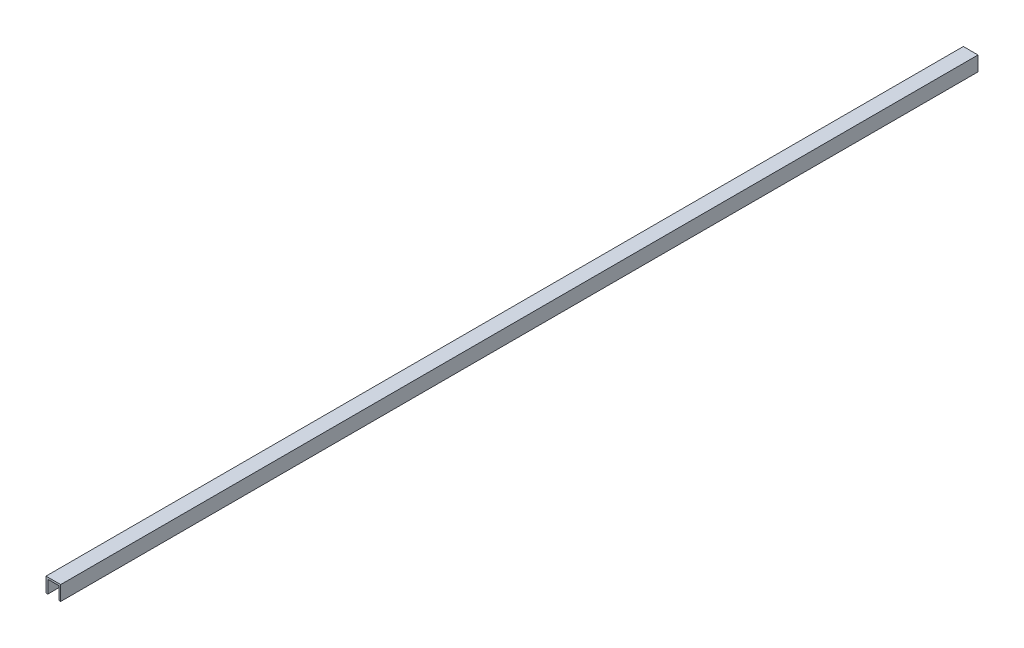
ISO-10303-21;
HEADER;
FILE_DESCRIPTION(('STEP AP214'),'2;1');
FILE_NAME('part.step','',(''),(''),'','','');
FILE_SCHEMA(('AUTOMOTIVE_DESIGN { 1 0 10303 214 1 1 1 1 }'));
ENDSEC;
DATA;
#1=APPLICATION_CONTEXT('core data for automotive mechanical design processes');
#2=APPLICATION_PROTOCOL_DEFINITION('international standard','automotive_design',2000,#1);
#3=PRODUCT_CONTEXT('',#1,'mechanical');
#4=PRODUCT('Part','Part','',(#3));
#5=PRODUCT_RELATED_PRODUCT_CATEGORY('part','',(#4));
#6=PRODUCT_DEFINITION_FORMATION('','',#4);
#7=PRODUCT_DEFINITION_CONTEXT('part definition',#1,'design');
#8=PRODUCT_DEFINITION('design','',#6,#7);
#9=PRODUCT_DEFINITION_SHAPE('','',#8);
#10=(LENGTH_UNIT() NAMED_UNIT(*) SI_UNIT(.MILLI.,.METRE.));
#11=(NAMED_UNIT(*) PLANE_ANGLE_UNIT() SI_UNIT($,.RADIAN.));
#12=(NAMED_UNIT(*) SI_UNIT($,.STERADIAN.) SOLID_ANGLE_UNIT());
#13=UNCERTAINTY_MEASURE_WITH_UNIT(LENGTH_MEASURE(1.E-05),#10,'distance_accuracy_value','');
#14=(GEOMETRIC_REPRESENTATION_CONTEXT(3) GLOBAL_UNCERTAINTY_ASSIGNED_CONTEXT((#13)) GLOBAL_UNIT_ASSIGNED_CONTEXT((#10,
#11,#12)) REPRESENTATION_CONTEXT('',''));
#15=CARTESIAN_POINT('',(0.,0.,0.));
#16=DIRECTION('',(0.,0.,1.));
#17=DIRECTION('',(1.,0.,0.));
#18=AXIS2_PLACEMENT_3D('',#15,#16,#17);
#19=CARTESIAN_POINT('',(4.,-4.,250.));
#20=DIRECTION('',(0.,-1.,0.));
#21=DIRECTION('',(1.,0.,0.));
#22=AXIS2_PLACEMENT_3D('',#19,#20,#21);
#23=PLANE('',#22);
#24=DIRECTION('',(-1.,0.,0.));
#25=VECTOR('',#24,1.);
#26=CARTESIAN_POINT('',(4.,-4.,250.));
#27=LINE('',#26,#25);
#28=CARTESIAN_POINT('',(4.,-4.,250.));
#29=VERTEX_POINT('',#28);
#30=CARTESIAN_POINT('',(3.,-4.,250.));
#31=VERTEX_POINT('',#30);
#32=EDGE_CURVE('E123',#29,#31,#27,.T.);
#33=ORIENTED_EDGE('',*,*,#32,.T.);
#34=DIRECTION('',(0.,0.,-1.));
#35=VECTOR('',#34,1.);
#36=CARTESIAN_POINT('',(3.,-4.,250.));
#37=LINE('',#36,#35);
#38=CARTESIAN_POINT('',(3.,-4.,-250.));
#39=VERTEX_POINT('',#38);
#40=EDGE_CURVE('E112',#31,#39,#37,.T.);
#41=ORIENTED_EDGE('',*,*,#40,.T.);
#42=DIRECTION('',(-1.,0.,0.));
#43=VECTOR('',#42,1.);
#44=CARTESIAN_POINT('',(4.,-4.,-250.));
#45=LINE('',#44,#43);
#46=CARTESIAN_POINT('',(4.,-4.,-250.));
#47=VERTEX_POINT('',#46);
#48=EDGE_CURVE('E121',#47,#39,#45,.T.);
#49=ORIENTED_EDGE('',*,*,#48,.F.);
#50=DIRECTION('',(0.,0.,-1.));
#51=VECTOR('',#50,1.);
#52=CARTESIAN_POINT('',(4.,-4.,250.));
#53=LINE('',#52,#51);
#54=EDGE_CURVE('E59',#29,#47,#53,.T.);
#55=ORIENTED_EDGE('',*,*,#54,.F.);
#56=EDGE_LOOP('',(#33,#41,#49,#55));
#57=FACE_BOUND('',#56,.T.);
#58=ADVANCED_FACE('F35',(#57),#23,.T.);
#59=CARTESIAN_POINT('',(4.,-4.,250.));
#60=DIRECTION('',(-1.,0.,0.));
#61=DIRECTION('',(0.,0.,1.));
#62=AXIS2_PLACEMENT_3D('',#59,#60,#61);
#63=PLANE('',#62);
#64=DIRECTION('',(0.,1.,0.));
#65=VECTOR('',#64,1.);
#66=CARTESIAN_POINT('',(4.,-4.,-250.));
#67=LINE('',#66,#65);
#68=CARTESIAN_POINT('',(4.,4.,-250.));
#69=VERTEX_POINT('',#68);
#70=EDGE_CURVE('E128',#47,#69,#67,.T.);
#71=ORIENTED_EDGE('',*,*,#70,.T.);
#72=DIRECTION('',(0.,0.,-1.));
#73=VECTOR('',#72,1.);
#74=CARTESIAN_POINT('',(4.,4.,250.));
#75=LINE('',#74,#73);
#76=CARTESIAN_POINT('',(4.,4.,250.));
#77=VERTEX_POINT('',#76);
#78=EDGE_CURVE('E11',#77,#69,#75,.T.);
#79=ORIENTED_EDGE('',*,*,#78,.F.);
#80=DIRECTION('',(0.,1.,0.));
#81=VECTOR('',#80,1.);
#82=CARTESIAN_POINT('',(4.,-4.,250.));
#83=LINE('',#82,#81);
#84=EDGE_CURVE('E129',#29,#77,#83,.T.);
#85=ORIENTED_EDGE('',*,*,#84,.F.);
#86=ORIENTED_EDGE('',*,*,#54,.T.);
#87=EDGE_LOOP('',(#71,#79,#85,#86));
#88=FACE_BOUND('',#87,.T.);
#89=ADVANCED_FACE('F37',(#88),#63,.F.);
#90=CARTESIAN_POINT('',(4.,4.,250.));
#91=DIRECTION('',(0.,-1.,0.));
#92=DIRECTION('',(1.,0.,0.));
#93=AXIS2_PLACEMENT_3D('',#90,#91,#92);
#94=PLANE('',#93);
#95=DIRECTION('',(-1.,0.,0.));
#96=VECTOR('',#95,1.);
#97=CARTESIAN_POINT('',(4.,4.,-250.));
#98=LINE('',#97,#96);
#99=CARTESIAN_POINT('',(-4.,4.,-250.));
#100=VERTEX_POINT('',#99);
#101=EDGE_CURVE('E149',#69,#100,#98,.T.);
#102=ORIENTED_EDGE('',*,*,#101,.T.);
#103=DIRECTION('',(0.,0.,-1.));
#104=VECTOR('',#103,1.);
#105=CARTESIAN_POINT('',(-4.,4.,250.));
#106=LINE('',#105,#104);
#107=CARTESIAN_POINT('',(-4.,4.,250.));
#108=VERTEX_POINT('',#107);
#109=EDGE_CURVE('E43',#108,#100,#106,.T.);
#110=ORIENTED_EDGE('',*,*,#109,.F.);
#111=DIRECTION('',(-1.,0.,0.));
#112=VECTOR('',#111,1.);
#113=CARTESIAN_POINT('',(4.,4.,250.));
#114=LINE('',#113,#112);
#115=EDGE_CURVE('E85',#77,#108,#114,.T.);
#116=ORIENTED_EDGE('',*,*,#115,.F.);
#117=ORIENTED_EDGE('',*,*,#78,.T.);
#118=EDGE_LOOP('',(#102,#110,#116,#117));
#119=FACE_BOUND('',#118,.T.);
#120=ADVANCED_FACE('F150',(#119),#94,.F.);
#121=CARTESIAN_POINT('',(-4.,-4.,250.));
#122=DIRECTION('',(-1.,0.,0.));
#123=DIRECTION('',(0.,0.,1.));
#124=AXIS2_PLACEMENT_3D('',#121,#122,#123);
#125=PLANE('',#124);
#126=DIRECTION('',(0.,1.,0.));
#127=VECTOR('',#126,1.);
#128=CARTESIAN_POINT('',(-4.,-4.,-250.));
#129=LINE('',#128,#127);
#130=CARTESIAN_POINT('',(-4.,-4.,-250.));
#131=VERTEX_POINT('',#130);
#132=EDGE_CURVE('E133',#131,#100,#129,.T.);
#133=ORIENTED_EDGE('',*,*,#132,.F.);
#134=DIRECTION('',(0.,0.,-1.));
#135=VECTOR('',#134,1.);
#136=CARTESIAN_POINT('',(-4.,-4.,250.));
#137=LINE('',#136,#135);
#138=CARTESIAN_POINT('',(-4.,-4.,250.));
#139=VERTEX_POINT('',#138);
#140=EDGE_CURVE('E138',#139,#131,#137,.T.);
#141=ORIENTED_EDGE('',*,*,#140,.F.);
#142=DIRECTION('',(0.,1.,0.));
#143=VECTOR('',#142,1.);
#144=CARTESIAN_POINT('',(-4.,-4.,250.));
#145=LINE('',#144,#143);
#146=EDGE_CURVE('E148',#139,#108,#145,.T.);
#147=ORIENTED_EDGE('',*,*,#146,.T.);
#148=ORIENTED_EDGE('',*,*,#109,.T.);
#149=EDGE_LOOP('',(#133,#141,#147,#148));
#150=FACE_BOUND('',#149,.T.);
#151=ADVANCED_FACE('F144',(#150),#125,.T.);
#152=DIRECTION('',(0.,0.,-1.));
#153=VECTOR('',#152,1.);
#154=CARTESIAN_POINT('',(-3.,-4.,250.));
#155=LINE('',#154,#153);
#156=CARTESIAN_POINT('',(-3.,-4.,250.));
#157=VERTEX_POINT('',#156);
#158=CARTESIAN_POINT('',(-3.,-4.,-250.));
#159=VERTEX_POINT('',#158);
#160=EDGE_CURVE('E124',#157,#159,#155,.T.);
#161=ORIENTED_EDGE('',*,*,#160,.F.);
#162=EDGE_CURVE('E157',#157,#139,#27,.T.);
#163=ORIENTED_EDGE('',*,*,#162,.T.);
#164=ORIENTED_EDGE('',*,*,#140,.T.);
#165=EDGE_CURVE('E130',#159,#131,#45,.T.);
#166=ORIENTED_EDGE('',*,*,#165,.F.);
#167=EDGE_LOOP('',(#161,#163,#164,#166));
#168=FACE_BOUND('',#167,.T.);
#169=ADVANCED_FACE('F155',(#168),#23,.T.);
#170=CARTESIAN_POINT('',(0.,0.,250.));
#171=DIRECTION('',(0.,0.,1.));
#172=DIRECTION('',(1.,0.,0.));
#173=AXIS2_PLACEMENT_3D('',#170,#171,#172);
#174=PLANE('',#173);
#175=DIRECTION('',(0.,1.,0.));
#176=VECTOR('',#175,1.);
#177=CARTESIAN_POINT('',(3.,-4.,250.));
#178=LINE('',#177,#176);
#179=CARTESIAN_POINT('',(3.,3.,250.));
#180=VERTEX_POINT('',#179);
#181=EDGE_CURVE('E169',#31,#180,#178,.T.);
#182=ORIENTED_EDGE('',*,*,#181,.F.);
#183=ORIENTED_EDGE('',*,*,#32,.F.);
#184=ORIENTED_EDGE('',*,*,#84,.T.);
#185=ORIENTED_EDGE('',*,*,#115,.T.);
#186=ORIENTED_EDGE('',*,*,#146,.F.);
#187=ORIENTED_EDGE('',*,*,#162,.F.);
#188=DIRECTION('',(0.,1.,0.));
#189=VECTOR('',#188,1.);
#190=CARTESIAN_POINT('',(-3.,-4.,250.));
#191=LINE('',#190,#189);
#192=CARTESIAN_POINT('',(-3.,3.,250.));
#193=VERTEX_POINT('',#192);
#194=EDGE_CURVE('E125',#157,#193,#191,.T.);
#195=ORIENTED_EDGE('',*,*,#194,.T.);
#196=DIRECTION('',(-1.,0.,0.));
#197=VECTOR('',#196,1.);
#198=CARTESIAN_POINT('',(4.,3.,250.));
#199=LINE('',#198,#197);
#200=EDGE_CURVE('E171',#180,#193,#199,.T.);
#201=ORIENTED_EDGE('',*,*,#200,.F.);
#202=EDGE_LOOP('',(#182,#183,#184,#185,#186,#187,#195,#201));
#203=FACE_BOUND('',#202,.T.);
#204=ADVANCED_FACE('F159',(#203),#174,.T.);
#205=CARTESIAN_POINT('',(0.,0.,-250.));
#206=DIRECTION('',(0.,0.,1.));
#207=DIRECTION('',(1.,0.,0.));
#208=AXIS2_PLACEMENT_3D('',#205,#206,#207);
#209=PLANE('',#208);
#210=ORIENTED_EDGE('',*,*,#48,.T.);
#211=DIRECTION('',(0.,1.,0.));
#212=VECTOR('',#211,1.);
#213=CARTESIAN_POINT('',(3.,-4.,-250.));
#214=LINE('',#213,#212);
#215=CARTESIAN_POINT('',(3.,3.,-250.));
#216=VERTEX_POINT('',#215);
#217=EDGE_CURVE('E109',#39,#216,#214,.T.);
#218=ORIENTED_EDGE('',*,*,#217,.T.);
#219=DIRECTION('',(-1.,0.,0.));
#220=VECTOR('',#219,1.);
#221=CARTESIAN_POINT('',(4.,3.,-250.));
#222=LINE('',#221,#220);
#223=CARTESIAN_POINT('',(-3.,3.,-250.));
#224=VERTEX_POINT('',#223);
#225=EDGE_CURVE('E119',#216,#224,#222,.T.);
#226=ORIENTED_EDGE('',*,*,#225,.T.);
#227=DIRECTION('',(0.,1.,0.));
#228=VECTOR('',#227,1.);
#229=CARTESIAN_POINT('',(-3.,-4.,-250.));
#230=LINE('',#229,#228);
#231=EDGE_CURVE('E50',#159,#224,#230,.T.);
#232=ORIENTED_EDGE('',*,*,#231,.F.);
#233=ORIENTED_EDGE('',*,*,#165,.T.);
#234=ORIENTED_EDGE('',*,*,#132,.T.);
#235=ORIENTED_EDGE('',*,*,#101,.F.);
#236=ORIENTED_EDGE('',*,*,#70,.F.);
#237=EDGE_LOOP('',(#210,#218,#226,#232,#233,#234,#235,#236));
#238=FACE_BOUND('',#237,.T.);
#239=ADVANCED_FACE('F127',(#238),#209,.F.);
#240=CARTESIAN_POINT('',(3.,-4.,250.));
#241=DIRECTION('',(-1.,0.,0.));
#242=DIRECTION('',(0.,0.,1.));
#243=AXIS2_PLACEMENT_3D('',#240,#241,#242);
#244=PLANE('',#243);
#245=ORIENTED_EDGE('',*,*,#217,.F.);
#246=ORIENTED_EDGE('',*,*,#40,.F.);
#247=ORIENTED_EDGE('',*,*,#181,.T.);
#248=DIRECTION('',(0.,0.,-1.));
#249=VECTOR('',#248,1.);
#250=CARTESIAN_POINT('',(3.,3.,250.));
#251=LINE('',#250,#249);
#252=EDGE_CURVE('E115',#180,#216,#251,.T.);
#253=ORIENTED_EDGE('',*,*,#252,.T.);
#254=EDGE_LOOP('',(#245,#246,#247,#253));
#255=FACE_BOUND('',#254,.T.);
#256=ADVANCED_FACE('F111',(#255),#244,.T.);
#257=CARTESIAN_POINT('',(4.,3.,250.));
#258=DIRECTION('',(0.,-1.,0.));
#259=DIRECTION('',(1.,0.,0.));
#260=AXIS2_PLACEMENT_3D('',#257,#258,#259);
#261=PLANE('',#260);
#262=ORIENTED_EDGE('',*,*,#225,.F.);
#263=ORIENTED_EDGE('',*,*,#252,.F.);
#264=ORIENTED_EDGE('',*,*,#200,.T.);
#265=DIRECTION('',(0.,0.,-1.));
#266=VECTOR('',#265,1.);
#267=CARTESIAN_POINT('',(-3.,3.,250.));
#268=LINE('',#267,#266);
#269=EDGE_CURVE('E165',#193,#224,#268,.T.);
#270=ORIENTED_EDGE('',*,*,#269,.T.);
#271=EDGE_LOOP('',(#262,#263,#264,#270));
#272=FACE_BOUND('',#271,.T.);
#273=ADVANCED_FACE('F177',(#272),#261,.T.);
#274=CARTESIAN_POINT('',(-3.,-4.,250.));
#275=DIRECTION('',(-1.,0.,0.));
#276=DIRECTION('',(0.,0.,1.));
#277=AXIS2_PLACEMENT_3D('',#274,#275,#276);
#278=PLANE('',#277);
#279=ORIENTED_EDGE('',*,*,#231,.T.);
#280=ORIENTED_EDGE('',*,*,#269,.F.);
#281=ORIENTED_EDGE('',*,*,#194,.F.);
#282=ORIENTED_EDGE('',*,*,#160,.T.);
#283=EDGE_LOOP('',(#279,#280,#281,#282));
#284=FACE_BOUND('',#283,.T.);
#285=ADVANCED_FACE('F179',(#284),#278,.F.);
#286=CLOSED_SHELL('',(#58,#89,#120,#151,#169,#204,#239,#256,#273,#285));
#287=MANIFOLD_SOLID_BREP('B2',#286);
#288=ADVANCED_BREP_SHAPE_REPRESENTATION('',(#18,#287),#14);
#289=SHAPE_DEFINITION_REPRESENTATION(#9,#288);
ENDSEC;
END-ISO-10303-21;
